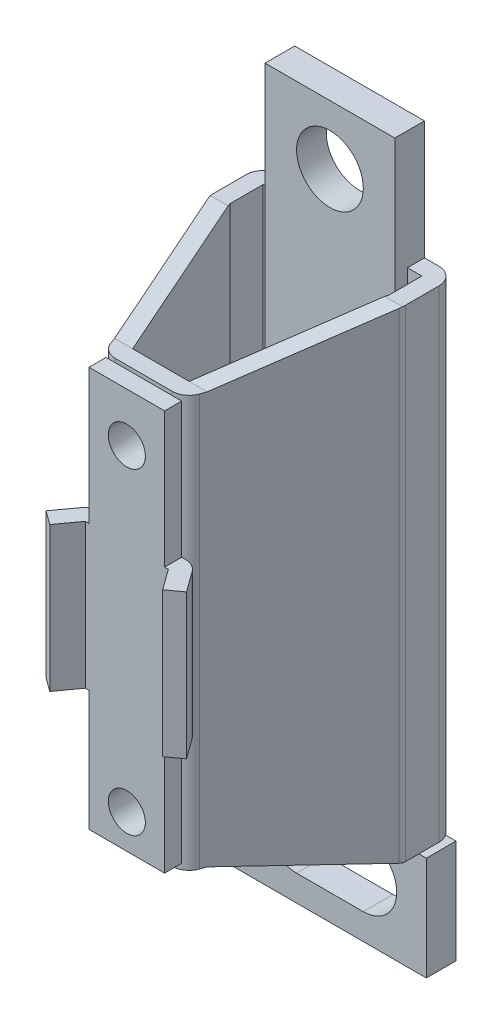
from build123d import *

# Parameters (mm, degrees)
BODY_SKETCH_W                   = 10.2
BODY_SKETCH_H                   = 54
BODY_DEPTH                      = 2.3
BRACKET_DEPTH                   = 9.75
SHELL_DEPTH                     = 32
SHELL_DEPTH_BACK                = 33
SHELL_TOP_PROFILE_DEPTH         = 48.370454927
SHELL_TOP_PROFILE_DEPTH_BACK    = 48.370454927
SHELL_BOTTOM_PROFILE_DEPTH      = 48.370454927
SHELL_BOTTOM_PROFILE_DEPTH_BACK = 48.370454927
SHELL_ROUNDS_R                  = 2.3
HOLES_REACH                     = 49.37
HOLES_SKETCH_R                  = 2.5
BOSS_SKETCH_R                   = 4
BOSS_SKETCH_R_2                 = 2.5
BOSS_DEPTH                      = 7.5
MGT_BRACKET_SKETCH_W            = 17.5
MGT_BRACKET_SKETCH_H            = 96
MGT_BRACKET_DEPTH               = 4
MGT_START                       = -4
MGT_FLANGE_SKETCH_W             = 26
MGT_FLANGE_SKETCH_H             = 14
MGT_FLANGE_DEPTH                = 4
MGT_HOLE_SKETCH_R               = 4.5
MGT_HOLE_DEPTH                  = 59.167285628
MGT_SLOT_TOP_DEPTH              = 95.486200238


with BuildPart() as part:
    # Body_Sketch → Body (new body)
    with BuildSketch(Plane.XY):
        with Locations((0, 1)):
            Rectangle(BODY_SKETCH_W, BODY_SKETCH_H)
    extrude(amount=-BODY_DEPTH)

    # Bracket_Sketch → Bracket (add, symmetric)
    with BuildSketch(Plane(origin=(0, 0, 0), x_dir=(1, 0, 0), z_dir=(0, 1, 0))):
        with BuildLine():
            Line((5.6, 0), (7.614981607, -2.773384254))
            Line((7.614981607, -2.773384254), (9.475720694, -1.421478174))
            Line((9.475720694, -1.421478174), (7.460739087, 1.35190608))
            ThreePointArc((7.460739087, 1.35190608), (6.644178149, 2.049315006), (5.6, 2.3))
            Line((5.6, 2.3), (0, 2.3))
            Line((0, 2.3), (0, 0))
            Line((0, 0), (5.6, 0))
        make_face()
    bracket = extrude(amount=BRACKET_DEPTH, both=True)

    # Bracket Mirror: Bracket across plane
    add(bracket.mirror(Plane(origin=(0, 0, 0), x_dir=(0, 0, 1), z_dir=(1, 0, 0))))

    # Shell_Sketch → Shell (add, two sides: drawn at the far end of the back side and taken through both)
    with BuildSketch(Plane(origin=(0, 0, 0), x_dir=(1, 0, 0), z_dir=(0, 1, 0)).offset(-SHELL_DEPTH_BACK)):
        with BuildLine():
            Line((5.984118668, 3.851193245), (13, 24.226792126))
            Line((13, 24.226792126), (13, 31.4))
            Line((13, 31.4), (-13, 31.4))
            Line((-13, 31.4), (-13, 24.226792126))
            Line((-13, 24.226792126), (-5.984118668, 3.851193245))
            ThreePointArc((-5.984118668, 3.851193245), (-5.145042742, 2.727534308), (-3.809425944, 2.3))
            Line((-3.809425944, 2.3), (3.809425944, 2.3))
            ThreePointArc((3.809425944, 2.3), (5.145042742, 2.727534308), (5.984118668, 3.851193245))
        make_face()
        Polygon((3.809425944, 4.6), (10.7, 24.611680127), (10.7, 29.1), (-10.7, 29.1), (-10.7, 24.611680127), (-3.809425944, 4.6), align=None, mode=Mode.SUBTRACT)
    extrude(amount=SHELL_DEPTH + SHELL_DEPTH_BACK)

    # Shell Top Profile_Sketch → Shell Top Profile (cut, two sides: drawn at the far end of the back side and taken through both)
    with BuildSketch(Plane(origin=(0, 0, 0), x_dir=(0, 0, -1), z_dir=(1, 0, 0)).offset(-SHELL_TOP_PROFILE_DEPTH_BACK)):
        Polygon((-154.571647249, 28.5), (2.3, 28.5), (4.6, 28.5), (24.226792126, 32), (31.4, 32), (188.271647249, 32), (185.068888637, 345.72694685), (-157.774405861, 342.22694685), align=None)
    extrude(amount=SHELL_TOP_PROFILE_DEPTH + SHELL_TOP_PROFILE_DEPTH_BACK, mode=Mode.SUBTRACT)

    # Shell Bottom Profile_Sketch → Shell Bottom Profile (cut, two sides: drawn at the far end of the back side and taken through both)
    with BuildSketch(Plane(origin=(0, 0, 0), x_dir=(0, 0, -1), z_dir=(1, 0, 0)).offset(-SHELL_BOTTOM_PROFILE_DEPTH_BACK)):
        Polygon((-154.571647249, -27), (2.3, -27), (4.6, -27), (24.226792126, -33), (31.4, -33), (188.271647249, -33), (182.781758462, -346.695259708), (-160.061536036, -340.695259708), align=None)
    extrude(amount=SHELL_BOTTOM_PROFILE_DEPTH + SHELL_BOTTOM_PROFILE_DEPTH_BACK, mode=Mode.SUBTRACT)

    # Shell Rounds
    shell_rounds_edges = [part.edges().sort_by_distance(p)[0] for p in [
        (13, -0.5, -24.226792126),
        (13, -0.5, -31.4),
        (-13, -0.5, -31.4),
        (-13, -0.5, -24.226792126),
    ]]
    fillet(shell_rounds_edges, radius=SHELL_ROUNDS_R)

    # Holes_Sketch → Holes (cut, up to next)
    with BuildSketch(Plane.XY, mode=Mode.PRIVATE) as holes_sk1:
        with Locations((0, 21.4)):
            Circle(HOLES_SKETCH_R)
    holes_tool1 = extrude(holes_sk1.sketch, amount=-HOLES_REACH, mode=Mode.PRIVATE) & part.part
    # Holes_Sketch → Holes (cut, up to next)
    with BuildSketch(Plane.XY, mode=Mode.PRIVATE) as holes_sk2:
        with Locations(Location((0, -21.4, 0), (0, 0, 180))):
            Circle(HOLES_SKETCH_R)
    holes_tool2 = extrude(holes_sk2.sketch, amount=-HOLES_REACH, mode=Mode.PRIVATE) & part.part
    add(holes_tool1.solids().sort_by_distance((0, 21.4, 0))[0], mode=Mode.SUBTRACT)
    add(holes_tool2.solids().sort_by_distance((0, -21.4, 0))[0], mode=Mode.SUBTRACT)

    # Boss_Sketch → Boss (add)
    with BuildSketch(Plane(origin=(0, 0, 0), x_dir=(-1, 0, 0), z_dir=(0, 0, -1))):
        with Locations(Location((0, 21.4, 0), (0, 0, 197.757387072))):
            Circle(BOSS_SKETCH_R)
        with Locations(Location((0, 21.4, 0), (0, 0, 180))):
            Circle(BOSS_SKETCH_R_2, mode=Mode.SUBTRACT)
    extrude(amount=BOSS_DEPTH)

    # MGT Bracket_Sketch → MGT Bracket (add)
    with BuildSketch(Plane(origin=(0, 0, -31.4), x_dir=(-1, 0, 0), z_dir=(0, 0, -1))):
        Rectangle(MGT_BRACKET_SKETCH_W, MGT_BRACKET_SKETCH_H)
    extrude(amount=-MGT_BRACKET_DEPTH)

    # MGT Flange_Sketch → MGT Flange (add)
    with BuildSketch(Plane.XY.offset(-27.4).offset(MGT_START)):
        with Locations((0, -41)):
            Rectangle(MGT_FLANGE_SKETCH_W, MGT_FLANGE_SKETCH_H)
    extrude(amount=MGT_FLANGE_DEPTH)

    # MGT Hole_Sketch → MGT Hole (cut, through all)
    with BuildSketch(Plane.XY.offset(-27.4)):
        with Locations((0, 40)):
            Circle(MGT_HOLE_SKETCH_R)
    extrude(amount=-MGT_HOLE_DEPTH, mode=Mode.SUBTRACT)

    # MGT Slot Top_Sketch → MGT Slot Top (cut, through all)
    with BuildSketch(Plane(origin=(9.522444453, -38.659958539, -27.4), x_dir=(1, 0, 0), z_dir=(0, 0, 1))):
        with BuildLine():
            Line((-14.022444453, 3.159958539), (-5.022444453, 3.159958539))
            ThreePointArc((-5.022444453, 3.159958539), (-0.522444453, -1.340041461), (-5.022444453, -5.840041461))
            Line((-5.022444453, -5.840041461), (-14.022444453, -5.840041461))
            ThreePointArc((-14.022444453, -5.840041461), (-18.522444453, -1.340041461), (-14.022444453, 3.159958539))
        make_face()
    extrude(amount=-MGT_SLOT_TOP_DEPTH, mode=Mode.SUBTRACT)


solid = part.part
